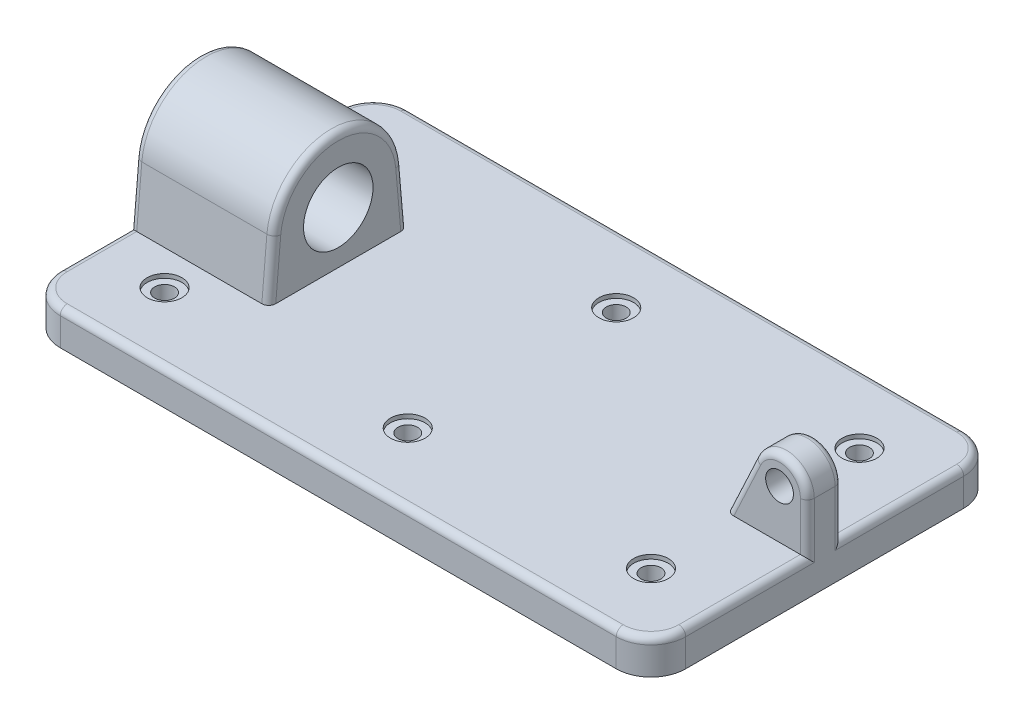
from build123d import *

# Parameters (mm, degrees)
SKETCH1_W                      = 114.3
SKETCH1_H                      = 6.35
BASE_EXTRUDE_DEPTH             = 31.75
LEVER_BOSS_DEPTH               = 3.175
BOSS_EXTRUDE2_DEPTH            = 25.4
FILLET1_R                      = 6.35
HOLE1_D                        = 5.08
HOLE2_D                        = 12.7
HOLE2_DEPTH                    = 25.4
F_4_SPOTFACE_HOLE1_D           = 3.6068
F_4_SPOTFACE_HOLE1_CBORE_D     = 6.35
F_4_SPOTFACE_HOLE1_CBORE_DEPTH = 0.762
LPATTERN1_COUNT                = 3
LPATTERN1_PITCH                = 44.45
LPATTERN1_COUNT_DIR2           = 2
LPATTERN1_PITCH_DIR2           = 38.1
FILLET2_R                      = 1.27


with BuildPart() as part:
    # Sketch1 → Base-Extrude (new, symmetric)
    with BuildSketch(Plane.XY):
        with Locations((57.15, 3.175)):
            Rectangle(SKETCH1_W, SKETCH1_H)
    extrude(amount=BASE_EXTRUDE_DEPTH, both=True)

    # Sketch2 → lever boss (add, symmetric)
    with BuildSketch(Plane.XY):
        with BuildLine():
            Line((114.3, 6.35), (114.3, 15.24))
            ThreePointArc((114.3, 15.24), (110.319513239, 20.199583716), (104.615956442, 17.38690077))
            Line((104.615956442, 17.38690077), (99.469365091, 6.35))
            Line((99.469365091, 6.35), (114.3, 6.35))
        make_face()
    extrude(amount=LEVER_BOSS_DEPTH, both=True)

    # Sketch3 → Boss-Extrude2 (add)
    with BuildSketch(Plane.ZY):
        with BuildLine():
            Line((12.7, 6.35), (11.776529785, 16.905312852))
            ThreePointArc((11.776529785, 16.905312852), (0, 27.696514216), (-11.776529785, 16.905312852))
            Line((-11.776529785, 16.905312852), (-12.7, 6.35))
            Line((-12.7, 6.35), (12.7, 6.35))
        make_face()
    extrude(amount=-BOSS_EXTRUDE2_DEPTH)

    # Fillet1
    fillet1_edges = [part.edges().sort_by_distance(p)[0] for p in [
        (114.3, 3.175, 31.75),
        (0, 3.175, 31.75),
        (114.3, 3.175, -31.75),
        (0, 3.175, -31.75),
    ]]
    fillet(fillet1_edges, radius=FILLET1_R)

    # Hole1 (through all)
    with Locations(Plane.XY.offset(3.175)):
        with Locations((109.22, 15.24)):
            Hole(HOLE1_D / 2)

    # Hole2
    with Locations(Plane(origin=(25.4, 3.190032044, 95.175064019), x_dir=(0, 0, -1), z_dir=(1, 0, 0))):
        with Locations((95.175064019, 12.684967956)):
            Hole(HOLE2_D / 2, depth=HOLE2_DEPTH)

    # 4 spotface hole1 (through all)
    with Locations(Plane(origin=(72.288522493, 6.35, 6.630777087), x_dir=(-1, 0, 0), z_dir=(0, 1, 0))):
        with Locations((-29.311477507, 12.419222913)):
            f_4_spotface_hole1 = CounterBoreHole(F_4_SPOTFACE_HOLE1_D / 2, F_4_SPOTFACE_HOLE1_CBORE_D / 2, F_4_SPOTFACE_HOLE1_CBORE_DEPTH)

    # LPattern1: 4 spotface hole1 3 × 2
    with Locations(*[(-i * LPATTERN1_PITCH, 0, -j * LPATTERN1_PITCH_DIR2) for i in range(LPATTERN1_COUNT) for j in range(LPATTERN1_COUNT_DIR2) if (i, j) != (0, 0)]):
        add(f_4_spotface_hole1, mode=Mode.SUBTRACT)

    # Fillet2
    fillet2_edges = [part.edges().sort_by_distance(p)[0] for p in [
        (114.3, 6.35, -14.2875),
        (114.3, 10.795, -3.175),
        (110.319513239, 20.199583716, -3.175),
        (102.042660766, 11.868450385, -3.175),
        (114.3, 10.795, 3.175),
        (110.319513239, 20.199583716, 3.175),
        (102.042660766, 11.868450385, 3.175),
        (0, 6.35, 19.05),
        (0, 11.627656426, -12.238264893),
        (0, 27.696514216, 0),
        (25.4, 11.627656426, 12.238264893),
        (25.4, 11.627656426, -12.238264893),
        (25.4, 27.696514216, 0),
        (0, 11.627656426, 12.238264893),
        (57.15, 6.35, -31.75),
        (57.15, 6.35, 31.75),
        (112.440128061, 6.35, -29.890128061),
        (112.440128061, 6.35, 29.890128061),
        (1.859871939, 6.35, 29.890128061),
        (1.859871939, 6.35, -29.890128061),
    ]]
    fillet(fillet2_edges, radius=FILLET2_R)


solid = part.part
